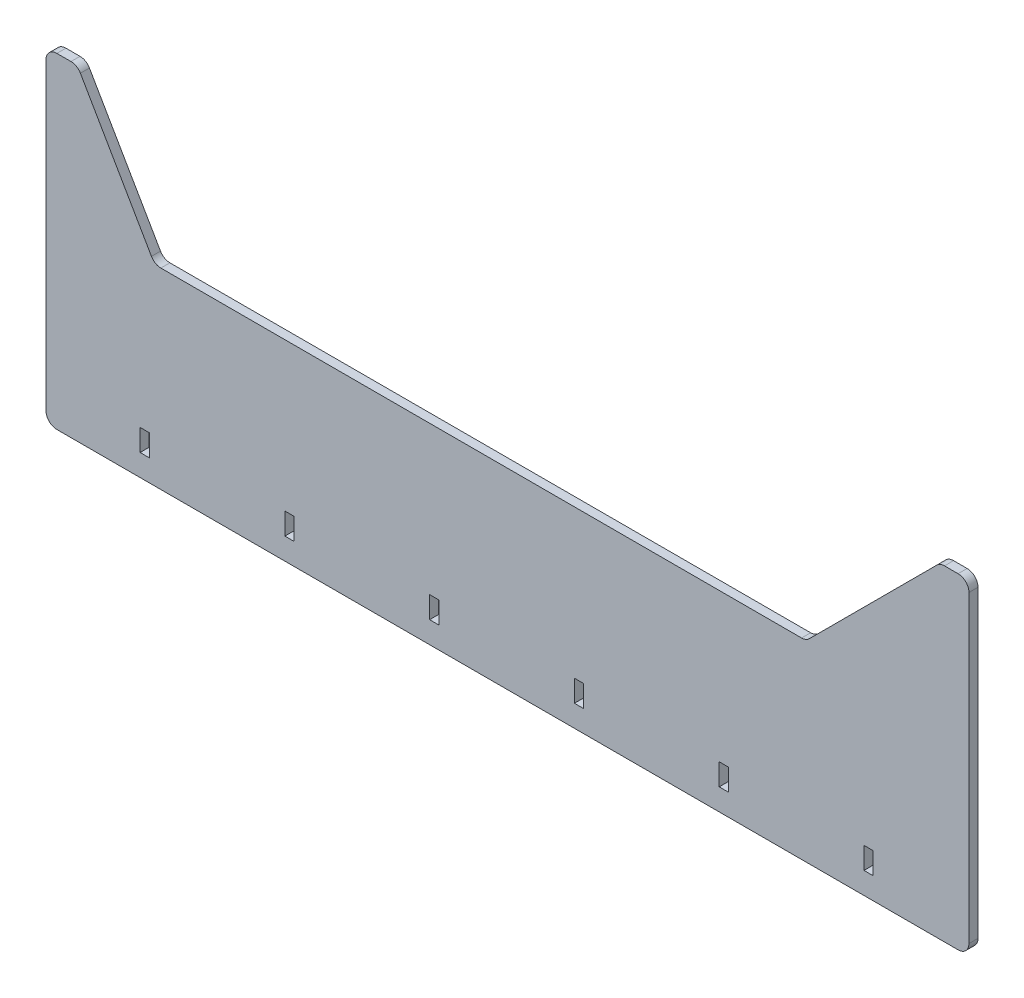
ISO-10303-21;
HEADER;
FILE_DESCRIPTION(('STEP AP214'),'2;1');
FILE_NAME('part.step','',(''),(''),'','','');
FILE_SCHEMA(('AUTOMOTIVE_DESIGN { 1 0 10303 214 1 1 1 1 }'));
ENDSEC;
DATA;
#1=APPLICATION_CONTEXT('core data for automotive mechanical design processes');
#2=APPLICATION_PROTOCOL_DEFINITION('international standard','automotive_design',2000,#1);
#3=PRODUCT_CONTEXT('',#1,'mechanical');
#4=PRODUCT('Part','Part','',(#3));
#5=PRODUCT_RELATED_PRODUCT_CATEGORY('part','',(#4));
#6=PRODUCT_DEFINITION_FORMATION('','',#4);
#7=PRODUCT_DEFINITION_CONTEXT('part definition',#1,'design');
#8=PRODUCT_DEFINITION('design','',#6,#7);
#9=PRODUCT_DEFINITION_SHAPE('','',#8);
#10=(LENGTH_UNIT() NAMED_UNIT(*) SI_UNIT(.MILLI.,.METRE.));
#11=(NAMED_UNIT(*) PLANE_ANGLE_UNIT() SI_UNIT($,.RADIAN.));
#12=(NAMED_UNIT(*) SI_UNIT($,.STERADIAN.) SOLID_ANGLE_UNIT());
#13=UNCERTAINTY_MEASURE_WITH_UNIT(LENGTH_MEASURE(1.E-05),#10,'distance_accuracy_value','');
#14=(GEOMETRIC_REPRESENTATION_CONTEXT(3) GLOBAL_UNCERTAINTY_ASSIGNED_CONTEXT((#13)) GLOBAL_UNIT_ASSIGNED_CONTEXT((#10,
#11,#12)) REPRESENTATION_CONTEXT('',''));
#15=CARTESIAN_POINT('',(0.,0.,0.));
#16=DIRECTION('',(0.,0.,1.));
#17=DIRECTION('',(1.,0.,0.));
#18=AXIS2_PLACEMENT_3D('',#15,#16,#17);
#19=CARTESIAN_POINT('',(0.,0.,2.5));
#20=DIRECTION('',(0.,0.,1.));
#21=DIRECTION('',(1.,0.,0.));
#22=AXIS2_PLACEMENT_3D('',#19,#20,#21);
#23=PLANE('',#22);
#24=DIRECTION('',(0.,-1.,0.));
#25=VECTOR('',#24,1.);
#26=CARTESIAN_POINT('',(-106.016483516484,44.8351648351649,2.5));
#27=LINE('',#26,#25);
#28=CARTESIAN_POINT('',(-106.016483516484,41.8351648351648,2.5));
#29=VERTEX_POINT('',#28);
#30=CARTESIAN_POINT('',(-106.016483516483,-42.1648351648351,2.5));
#31=VERTEX_POINT('',#30);
#32=EDGE_CURVE('E488',#29,#31,#27,.T.);
#33=ORIENTED_EDGE('',*,*,#32,.T.);
#34=CARTESIAN_POINT('',(-103.016483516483,-42.1648351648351,2.5));
#35=DIRECTION('',(0.,0.,1.));
#36=DIRECTION('',(1.,0.,0.));
#37=AXIS2_PLACEMENT_3D('',#34,#35,#36);
#38=CIRCLE('',#37,3.);
#39=CARTESIAN_POINT('',(-103.016483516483,-45.1648351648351,2.5));
#40=VERTEX_POINT('',#39);
#41=EDGE_CURVE('E563',#31,#40,#38,.T.);
#42=ORIENTED_EDGE('',*,*,#41,.T.);
#43=DIRECTION('',(1.,0.,0.));
#44=VECTOR('',#43,1.);
#45=CARTESIAN_POINT('',(-106.016483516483,-45.1648351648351,2.5));
#46=LINE('',#45,#44);
#47=CARTESIAN_POINT('',(145.983516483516,-45.1648351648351,2.5));
#48=VERTEX_POINT('',#47);
#49=EDGE_CURVE('E491',#40,#48,#46,.T.);
#50=ORIENTED_EDGE('',*,*,#49,.T.);
#51=CARTESIAN_POINT('',(145.983516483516,-42.1648351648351,2.5));
#52=DIRECTION('',(0.,0.,1.));
#53=DIRECTION('',(1.,0.,0.));
#54=AXIS2_PLACEMENT_3D('',#51,#52,#53);
#55=CIRCLE('',#54,3.);
#56=CARTESIAN_POINT('',(148.983516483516,-42.1648351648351,2.5));
#57=VERTEX_POINT('',#56);
#58=EDGE_CURVE('E561',#48,#57,#55,.T.);
#59=ORIENTED_EDGE('',*,*,#58,.T.);
#60=DIRECTION('',(0.,1.,0.));
#61=VECTOR('',#60,1.);
#62=CARTESIAN_POINT('',(148.983516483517,44.8351648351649,2.5));
#63=LINE('',#62,#61);
#64=CARTESIAN_POINT('',(148.983516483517,41.8351648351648,2.5));
#65=VERTEX_POINT('',#64);
#66=EDGE_CURVE('E495',#57,#65,#63,.T.);
#67=ORIENTED_EDGE('',*,*,#66,.T.);
#68=CARTESIAN_POINT('',(145.983516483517,41.8351648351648,2.5));
#69=DIRECTION('',(0.,0.,1.));
#70=DIRECTION('',(1.,0.,0.));
#71=AXIS2_PLACEMENT_3D('',#68,#69,#70);
#72=CIRCLE('',#71,3.);
#73=CARTESIAN_POINT('',(145.983516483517,44.8351648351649,2.5));
#74=VERTEX_POINT('',#73);
#75=EDGE_CURVE('E559',#65,#74,#72,.T.);
#76=ORIENTED_EDGE('',*,*,#75,.T.);
#77=DIRECTION('',(-1.,0.,0.));
#78=VECTOR('',#77,1.);
#79=CARTESIAN_POINT('',(140.983516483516,44.8351648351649,2.5));
#80=LINE('',#79,#78);
#81=CARTESIAN_POINT('',(142.226157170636,44.8351648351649,2.5));
#82=VERTEX_POINT('',#81);
#83=EDGE_CURVE('E498',#74,#82,#80,.T.);
#84=ORIENTED_EDGE('',*,*,#83,.T.);
#85=CARTESIAN_POINT('',(142.226157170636,41.8351648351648,2.5));
#86=DIRECTION('',(0.,0.,1.));
#87=DIRECTION('',(1.,0.,0.));
#88=AXIS2_PLACEMENT_3D('',#85,#86,#87);
#89=CIRCLE('',#88,3.);
#90=CARTESIAN_POINT('',(140.104836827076,43.9564851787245,2.5));
#91=VERTEX_POINT('',#90);
#92=EDGE_CURVE('E557',#82,#91,#89,.T.);
#93=ORIENTED_EDGE('',*,*,#92,.T.);
#94=DIRECTION('',(-0.707106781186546,-0.707106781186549,0.));
#95=VECTOR('',#94,1.);
#96=CARTESIAN_POINT('',(103.983516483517,7.83516483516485,2.5));
#97=LINE('',#96,#95);
#98=CARTESIAN_POINT('',(104.862196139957,8.71384449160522,2.5));
#99=VERTEX_POINT('',#98);
#100=EDGE_CURVE('E501',#91,#99,#97,.T.);
#101=ORIENTED_EDGE('',*,*,#100,.T.);
#102=CARTESIAN_POINT('',(102.740875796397,10.8351648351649,2.5));
#103=DIRECTION('',(0.,0.,1.));
#104=DIRECTION('',(1.,0.,0.));
#105=AXIS2_PLACEMENT_3D('',#102,#103,#104);
#106=CIRCLE('',#105,3.);
#107=CARTESIAN_POINT('',(102.740875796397,7.83516483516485,2.5));
#108=VERTEX_POINT('',#107);
#109=EDGE_CURVE('E596',#99,#108,#106,.F.);
#110=ORIENTED_EDGE('',*,*,#109,.T.);
#111=DIRECTION('',(-1.,0.,0.));
#112=VECTOR('',#111,1.);
#113=CARTESIAN_POINT('',(-76.0164835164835,7.83516483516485,2.5));
#114=LINE('',#113,#112);
#115=CARTESIAN_POINT('',(-74.2844327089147,7.83516483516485,2.5));
#116=VERTEX_POINT('',#115);
#117=EDGE_CURVE('E504',#108,#116,#114,.T.);
#118=ORIENTED_EDGE('',*,*,#117,.T.);
#119=CARTESIAN_POINT('',(-74.2844327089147,10.8351648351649,2.5));
#120=DIRECTION('',(0.,0.,1.));
#121=DIRECTION('',(1.,0.,0.));
#122=AXIS2_PLACEMENT_3D('',#119,#120,#121);
#123=CIRCLE('',#122,3.);
#124=CARTESIAN_POINT('',(-76.882508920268,9.33516483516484,2.5));
#125=VERTEX_POINT('',#124);
#126=EDGE_CURVE('E11',#116,#125,#123,.F.);
#127=ORIENTED_EDGE('',*,*,#126,.T.);
#128=DIRECTION('',(-0.500000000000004,0.866025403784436,0.));
#129=VECTOR('',#128,1.);
#130=CARTESIAN_POINT('',(-76.0164835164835,7.83516483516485,2.5));
#131=LINE('',#130,#129);
#132=CARTESIAN_POINT('',(-96.5124180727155,43.3351648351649,2.5));
#133=VERTEX_POINT('',#132);
#134=EDGE_CURVE('E507',#125,#133,#131,.T.);
#135=ORIENTED_EDGE('',*,*,#134,.T.);
#136=CARTESIAN_POINT('',(-99.1104942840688,41.8351648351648,2.5));
#137=DIRECTION('',(0.,0.,1.));
#138=DIRECTION('',(1.,0.,0.));
#139=AXIS2_PLACEMENT_3D('',#136,#137,#138);
#140=CIRCLE('',#139,3.);
#141=CARTESIAN_POINT('',(-99.1104942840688,44.8351648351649,2.5));
#142=VERTEX_POINT('',#141);
#143=EDGE_CURVE('E55',#133,#142,#140,.T.);
#144=ORIENTED_EDGE('',*,*,#143,.T.);
#145=DIRECTION('',(-1.,0.,0.));
#146=VECTOR('',#145,1.);
#147=CARTESIAN_POINT('',(-106.016483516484,44.8351648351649,2.5));
#148=LINE('',#147,#146);
#149=CARTESIAN_POINT('',(-103.016483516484,44.8351648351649,2.5));
#150=VERTEX_POINT('',#149);
#151=EDGE_CURVE('E509',#142,#150,#148,.T.);
#152=ORIENTED_EDGE('',*,*,#151,.T.);
#153=CARTESIAN_POINT('',(-103.016483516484,41.8351648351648,2.5));
#154=DIRECTION('',(0.,0.,1.));
#155=DIRECTION('',(1.,0.,0.));
#156=AXIS2_PLACEMENT_3D('',#153,#154,#155);
#157=CIRCLE('',#156,3.);
#158=EDGE_CURVE('E554',#150,#29,#157,.T.);
#159=ORIENTED_EDGE('',*,*,#158,.T.);
#160=EDGE_LOOP('',(#33,#42,#50,#59,#67,#76,#84,#93,#101,#110,#118,#127,#135,#144,#152,#159));
#161=FACE_BOUND('',#160,.T.);
#162=DIRECTION('',(1.,0.,0.));
#163=VECTOR('',#162,1.);
#164=CARTESIAN_POINT('',(-80.0164835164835,-39.1648351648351,2.5));
#165=LINE('',#164,#163);
#166=CARTESIAN_POINT('',(-80.0164835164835,-39.1648351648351,2.5));
#167=VERTEX_POINT('',#166);
#168=CARTESIAN_POINT('',(-77.4864835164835,-39.1648351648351,2.5));
#169=VERTEX_POINT('',#168);
#170=EDGE_CURVE('E459',#167,#169,#165,.T.);
#171=ORIENTED_EDGE('',*,*,#170,.F.);
#172=DIRECTION('',(0.,-1.,0.));
#173=VECTOR('',#172,1.);
#174=CARTESIAN_POINT('',(-80.0164835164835,-33.1648351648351,2.5));
#175=LINE('',#174,#173);
#176=CARTESIAN_POINT('',(-80.0164835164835,-33.1648351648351,2.5));
#177=VERTEX_POINT('',#176);
#178=EDGE_CURVE('E457',#177,#167,#175,.T.);
#179=ORIENTED_EDGE('',*,*,#178,.F.);
#180=DIRECTION('',(-1.,0.,0.));
#181=VECTOR('',#180,1.);
#182=CARTESIAN_POINT('',(-80.0164835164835,-33.1648351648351,2.5));
#183=LINE('',#182,#181);
#184=CARTESIAN_POINT('',(-77.4864835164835,-33.1648351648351,2.5));
#185=VERTEX_POINT('',#184);
#186=EDGE_CURVE('E465',#185,#177,#183,.T.);
#187=ORIENTED_EDGE('',*,*,#186,.F.);
#188=DIRECTION('',(0.,1.,0.));
#189=VECTOR('',#188,1.);
#190=CARTESIAN_POINT('',(-77.4864835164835,-33.1648351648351,2.5));
#191=LINE('',#190,#189);
#192=EDGE_CURVE('E462',#169,#185,#191,.T.);
#193=ORIENTED_EDGE('',*,*,#192,.F.);
#194=EDGE_LOOP('',(#171,#179,#187,#193));
#195=FACE_BOUND('',#194,.T.);
#196=DIRECTION('',(1.,0.,0.));
#197=VECTOR('',#196,1.);
#198=CARTESIAN_POINT('',(-40.0164835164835,-39.1648351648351,2.5));
#199=LINE('',#198,#197);
#200=CARTESIAN_POINT('',(-40.0164835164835,-39.1648351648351,2.5));
#201=VERTEX_POINT('',#200);
#202=CARTESIAN_POINT('',(-37.4864835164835,-39.1648351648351,2.5));
#203=VERTEX_POINT('',#202);
#204=EDGE_CURVE('E428',#201,#203,#199,.T.);
#205=ORIENTED_EDGE('',*,*,#204,.F.);
#206=DIRECTION('',(0.,-1.,0.));
#207=VECTOR('',#206,1.);
#208=CARTESIAN_POINT('',(-40.0164835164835,-33.1648351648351,2.5));
#209=LINE('',#208,#207);
#210=CARTESIAN_POINT('',(-40.0164835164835,-33.1648351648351,2.5));
#211=VERTEX_POINT('',#210);
#212=EDGE_CURVE('E426',#211,#201,#209,.T.);
#213=ORIENTED_EDGE('',*,*,#212,.F.);
#214=DIRECTION('',(-1.,0.,0.));
#215=VECTOR('',#214,1.);
#216=CARTESIAN_POINT('',(-40.0164835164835,-33.1648351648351,2.5));
#217=LINE('',#216,#215);
#218=CARTESIAN_POINT('',(-37.4864835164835,-33.1648351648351,2.5));
#219=VERTEX_POINT('',#218);
#220=EDGE_CURVE('E434',#219,#211,#217,.T.);
#221=ORIENTED_EDGE('',*,*,#220,.F.);
#222=DIRECTION('',(0.,1.,0.));
#223=VECTOR('',#222,1.);
#224=CARTESIAN_POINT('',(-37.4864835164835,-33.1648351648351,2.5));
#225=LINE('',#224,#223);
#226=EDGE_CURVE('E431',#203,#219,#225,.T.);
#227=ORIENTED_EDGE('',*,*,#226,.F.);
#228=EDGE_LOOP('',(#205,#213,#221,#227));
#229=FACE_BOUND('',#228,.T.);
#230=DIRECTION('',(1.,0.,0.));
#231=VECTOR('',#230,1.);
#232=CARTESIAN_POINT('',(-0.0164835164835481,-39.1648351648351,2.5));
#233=LINE('',#232,#231);
#234=CARTESIAN_POINT('',(-0.0164835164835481,-39.1648351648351,2.5));
#235=VERTEX_POINT('',#234);
#236=CARTESIAN_POINT('',(2.51351648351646,-39.1648351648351,2.5));
#237=VERTEX_POINT('',#236);
#238=EDGE_CURVE('E397',#235,#237,#233,.T.);
#239=ORIENTED_EDGE('',*,*,#238,.F.);
#240=DIRECTION('',(0.,-1.,0.));
#241=VECTOR('',#240,1.);
#242=CARTESIAN_POINT('',(-0.0164835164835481,-33.1648351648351,2.5));
#243=LINE('',#242,#241);
#244=CARTESIAN_POINT('',(-0.0164835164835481,-33.1648351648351,2.5));
#245=VERTEX_POINT('',#244);
#246=EDGE_CURVE('E395',#245,#235,#243,.T.);
#247=ORIENTED_EDGE('',*,*,#246,.F.);
#248=DIRECTION('',(-1.,0.,0.));
#249=VECTOR('',#248,1.);
#250=CARTESIAN_POINT('',(-0.0164835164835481,-33.1648351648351,2.5));
#251=LINE('',#250,#249);
#252=CARTESIAN_POINT('',(2.51351648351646,-33.1648351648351,2.5));
#253=VERTEX_POINT('',#252);
#254=EDGE_CURVE('E403',#253,#245,#251,.T.);
#255=ORIENTED_EDGE('',*,*,#254,.F.);
#256=DIRECTION('',(0.,1.,0.));
#257=VECTOR('',#256,1.);
#258=CARTESIAN_POINT('',(2.51351648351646,-33.1648351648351,2.5));
#259=LINE('',#258,#257);
#260=EDGE_CURVE('E400',#237,#253,#259,.T.);
#261=ORIENTED_EDGE('',*,*,#260,.F.);
#262=EDGE_LOOP('',(#239,#247,#255,#261));
#263=FACE_BOUND('',#262,.T.);
#264=DIRECTION('',(1.,0.,0.));
#265=VECTOR('',#264,1.);
#266=CARTESIAN_POINT('',(39.9835164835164,-39.1648351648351,2.5));
#267=LINE('',#266,#265);
#268=CARTESIAN_POINT('',(39.9835164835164,-39.1648351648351,2.5));
#269=VERTEX_POINT('',#268);
#270=CARTESIAN_POINT('',(42.5135164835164,-39.1648351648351,2.5));
#271=VERTEX_POINT('',#270);
#272=EDGE_CURVE('E366',#269,#271,#267,.T.);
#273=ORIENTED_EDGE('',*,*,#272,.F.);
#274=DIRECTION('',(0.,-1.,0.));
#275=VECTOR('',#274,1.);
#276=CARTESIAN_POINT('',(39.9835164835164,-33.1648351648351,2.5));
#277=LINE('',#276,#275);
#278=CARTESIAN_POINT('',(39.9835164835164,-33.1648351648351,2.5));
#279=VERTEX_POINT('',#278);
#280=EDGE_CURVE('E364',#279,#269,#277,.T.);
#281=ORIENTED_EDGE('',*,*,#280,.F.);
#282=DIRECTION('',(-1.,0.,0.));
#283=VECTOR('',#282,1.);
#284=CARTESIAN_POINT('',(39.9835164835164,-33.1648351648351,2.5));
#285=LINE('',#284,#283);
#286=CARTESIAN_POINT('',(42.5135164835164,-33.1648351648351,2.5));
#287=VERTEX_POINT('',#286);
#288=EDGE_CURVE('E372',#287,#279,#285,.T.);
#289=ORIENTED_EDGE('',*,*,#288,.F.);
#290=DIRECTION('',(0.,1.,0.));
#291=VECTOR('',#290,1.);
#292=CARTESIAN_POINT('',(42.5135164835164,-33.1648351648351,2.5));
#293=LINE('',#292,#291);
#294=EDGE_CURVE('E369',#271,#287,#293,.T.);
#295=ORIENTED_EDGE('',*,*,#294,.F.);
#296=EDGE_LOOP('',(#273,#281,#289,#295));
#297=FACE_BOUND('',#296,.T.);
#298=DIRECTION('',(1.,0.,0.));
#299=VECTOR('',#298,1.);
#300=CARTESIAN_POINT('',(79.9835164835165,-39.1648351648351,2.5));
#301=LINE('',#300,#299);
#302=CARTESIAN_POINT('',(79.9835164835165,-39.1648351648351,2.5));
#303=VERTEX_POINT('',#302);
#304=CARTESIAN_POINT('',(82.5135164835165,-39.1648351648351,2.5));
#305=VERTEX_POINT('',#304);
#306=EDGE_CURVE('E335',#303,#305,#301,.T.);
#307=ORIENTED_EDGE('',*,*,#306,.F.);
#308=DIRECTION('',(0.,-1.,0.));
#309=VECTOR('',#308,1.);
#310=CARTESIAN_POINT('',(79.9835164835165,-33.1648351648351,2.5));
#311=LINE('',#310,#309);
#312=CARTESIAN_POINT('',(79.9835164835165,-33.1648351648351,2.5));
#313=VERTEX_POINT('',#312);
#314=EDGE_CURVE('E333',#313,#303,#311,.T.);
#315=ORIENTED_EDGE('',*,*,#314,.F.);
#316=DIRECTION('',(-1.,0.,0.));
#317=VECTOR('',#316,1.);
#318=CARTESIAN_POINT('',(79.9835164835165,-33.1648351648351,2.5));
#319=LINE('',#318,#317);
#320=CARTESIAN_POINT('',(82.5135164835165,-33.1648351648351,2.5));
#321=VERTEX_POINT('',#320);
#322=EDGE_CURVE('E341',#321,#313,#319,.T.);
#323=ORIENTED_EDGE('',*,*,#322,.F.);
#324=DIRECTION('',(0.,1.,0.));
#325=VECTOR('',#324,1.);
#326=CARTESIAN_POINT('',(82.5135164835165,-33.1648351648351,2.5));
#327=LINE('',#326,#325);
#328=EDGE_CURVE('E338',#305,#321,#327,.T.);
#329=ORIENTED_EDGE('',*,*,#328,.F.);
#330=EDGE_LOOP('',(#307,#315,#323,#329));
#331=FACE_BOUND('',#330,.T.);
#332=DIRECTION('',(1.,0.,0.));
#333=VECTOR('',#332,1.);
#334=CARTESIAN_POINT('',(119.983516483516,-39.1648351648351,2.5));
#335=LINE('',#334,#333);
#336=CARTESIAN_POINT('',(119.983516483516,-39.1648351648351,2.5));
#337=VERTEX_POINT('',#336);
#338=CARTESIAN_POINT('',(122.513516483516,-39.1648351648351,2.5));
#339=VERTEX_POINT('',#338);
#340=EDGE_CURVE('E302',#337,#339,#335,.T.);
#341=ORIENTED_EDGE('',*,*,#340,.F.);
#342=DIRECTION('',(0.,-1.,0.));
#343=VECTOR('',#342,1.);
#344=CARTESIAN_POINT('',(119.983516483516,-33.1648351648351,2.5));
#345=LINE('',#344,#343);
#346=CARTESIAN_POINT('',(119.983516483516,-33.1648351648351,2.5));
#347=VERTEX_POINT('',#346);
#348=EDGE_CURVE('E292',#347,#337,#345,.T.);
#349=ORIENTED_EDGE('',*,*,#348,.F.);
#350=DIRECTION('',(-1.,0.,0.));
#351=VECTOR('',#350,1.);
#352=CARTESIAN_POINT('',(119.983516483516,-33.1648351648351,2.5));
#353=LINE('',#352,#351);
#354=CARTESIAN_POINT('',(122.513516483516,-33.1648351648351,2.5));
#355=VERTEX_POINT('',#354);
#356=EDGE_CURVE('E317',#355,#347,#353,.T.);
#357=ORIENTED_EDGE('',*,*,#356,.F.);
#358=DIRECTION('',(0.,1.,0.));
#359=VECTOR('',#358,1.);
#360=CARTESIAN_POINT('',(122.513516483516,-33.1648351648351,2.5));
#361=LINE('',#360,#359);
#362=EDGE_CURVE('E315',#339,#355,#361,.T.);
#363=ORIENTED_EDGE('',*,*,#362,.F.);
#364=EDGE_LOOP('',(#341,#349,#357,#363));
#365=FACE_BOUND('',#364,.T.);
#366=ADVANCED_FACE('F33',(#161,#195,#229,#263,#297,#331,#365),#23,.T.);
#367=CARTESIAN_POINT('',(0.,0.,0.));
#368=DIRECTION('',(0.,0.,1.));
#369=DIRECTION('',(1.,0.,0.));
#370=AXIS2_PLACEMENT_3D('',#367,#368,#369);
#371=PLANE('',#370);
#372=DIRECTION('',(0.,-1.,0.));
#373=VECTOR('',#372,1.);
#374=CARTESIAN_POINT('',(79.9835164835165,-33.1648351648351,0.));
#375=LINE('',#374,#373);
#376=CARTESIAN_POINT('',(79.9835164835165,-33.1648351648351,0.));
#377=VERTEX_POINT('',#376);
#378=CARTESIAN_POINT('',(79.9835164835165,-39.1648351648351,0.));
#379=VERTEX_POINT('',#378);
#380=EDGE_CURVE('E310',#377,#379,#375,.T.);
#381=ORIENTED_EDGE('',*,*,#380,.T.);
#382=DIRECTION('',(1.,0.,0.));
#383=VECTOR('',#382,1.);
#384=CARTESIAN_POINT('',(79.9835164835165,-39.1648351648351,0.));
#385=LINE('',#384,#383);
#386=CARTESIAN_POINT('',(82.5135164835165,-39.1648351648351,0.));
#387=VERTEX_POINT('',#386);
#388=EDGE_CURVE('E346',#379,#387,#385,.T.);
#389=ORIENTED_EDGE('',*,*,#388,.T.);
#390=DIRECTION('',(0.,1.,0.));
#391=VECTOR('',#390,1.);
#392=CARTESIAN_POINT('',(82.5135164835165,-33.1648351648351,0.));
#393=LINE('',#392,#391);
#394=CARTESIAN_POINT('',(82.5135164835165,-33.1648351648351,0.));
#395=VERTEX_POINT('',#394);
#396=EDGE_CURVE('E349',#387,#395,#393,.T.);
#397=ORIENTED_EDGE('',*,*,#396,.T.);
#398=DIRECTION('',(-1.,0.,0.));
#399=VECTOR('',#398,1.);
#400=CARTESIAN_POINT('',(79.9835164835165,-33.1648351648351,0.));
#401=LINE('',#400,#399);
#402=EDGE_CURVE('E336',#395,#377,#401,.T.);
#403=ORIENTED_EDGE('',*,*,#402,.T.);
#404=EDGE_LOOP('',(#381,#389,#397,#403));
#405=FACE_BOUND('',#404,.T.);
#406=DIRECTION('',(0.,-1.,0.));
#407=VECTOR('',#406,1.);
#408=CARTESIAN_POINT('',(-0.0164835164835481,-33.1648351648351,0.));
#409=LINE('',#408,#407);
#410=CARTESIAN_POINT('',(-0.0164835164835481,-33.1648351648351,0.));
#411=VERTEX_POINT('',#410);
#412=CARTESIAN_POINT('',(-0.0164835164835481,-39.1648351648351,0.));
#413=VERTEX_POINT('',#412);
#414=EDGE_CURVE('E394',#411,#413,#409,.T.);
#415=ORIENTED_EDGE('',*,*,#414,.T.);
#416=DIRECTION('',(1.,0.,0.));
#417=VECTOR('',#416,1.);
#418=CARTESIAN_POINT('',(-0.0164835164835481,-39.1648351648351,0.));
#419=LINE('',#418,#417);
#420=CARTESIAN_POINT('',(2.51351648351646,-39.1648351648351,0.));
#421=VERTEX_POINT('',#420);
#422=EDGE_CURVE('E408',#413,#421,#419,.T.);
#423=ORIENTED_EDGE('',*,*,#422,.T.);
#424=DIRECTION('',(0.,1.,0.));
#425=VECTOR('',#424,1.);
#426=CARTESIAN_POINT('',(2.51351648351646,-33.1648351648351,0.));
#427=LINE('',#426,#425);
#428=CARTESIAN_POINT('',(2.51351648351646,-33.1648351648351,0.));
#429=VERTEX_POINT('',#428);
#430=EDGE_CURVE('E411',#421,#429,#427,.T.);
#431=ORIENTED_EDGE('',*,*,#430,.T.);
#432=DIRECTION('',(-1.,0.,0.));
#433=VECTOR('',#432,1.);
#434=CARTESIAN_POINT('',(-0.0164835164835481,-33.1648351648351,0.));
#435=LINE('',#434,#433);
#436=EDGE_CURVE('E398',#429,#411,#435,.T.);
#437=ORIENTED_EDGE('',*,*,#436,.T.);
#438=EDGE_LOOP('',(#415,#423,#431,#437));
#439=FACE_BOUND('',#438,.T.);
#440=DIRECTION('',(0.,-1.,0.));
#441=VECTOR('',#440,1.);
#442=CARTESIAN_POINT('',(-80.0164835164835,-33.1648351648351,0.));
#443=LINE('',#442,#441);
#444=CARTESIAN_POINT('',(-80.0164835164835,-33.1648351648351,0.));
#445=VERTEX_POINT('',#444);
#446=CARTESIAN_POINT('',(-80.0164835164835,-39.1648351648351,0.));
#447=VERTEX_POINT('',#446);
#448=EDGE_CURVE('E456',#445,#447,#443,.T.);
#449=ORIENTED_EDGE('',*,*,#448,.T.);
#450=DIRECTION('',(1.,0.,0.));
#451=VECTOR('',#450,1.);
#452=CARTESIAN_POINT('',(-80.0164835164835,-39.1648351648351,0.));
#453=LINE('',#452,#451);
#454=CARTESIAN_POINT('',(-77.4864835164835,-39.1648351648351,0.));
#455=VERTEX_POINT('',#454);
#456=EDGE_CURVE('E470',#447,#455,#453,.T.);
#457=ORIENTED_EDGE('',*,*,#456,.T.);
#458=DIRECTION('',(0.,1.,0.));
#459=VECTOR('',#458,1.);
#460=CARTESIAN_POINT('',(-77.4864835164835,-33.1648351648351,0.));
#461=LINE('',#460,#459);
#462=CARTESIAN_POINT('',(-77.4864835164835,-33.1648351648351,0.));
#463=VERTEX_POINT('',#462);
#464=EDGE_CURVE('E473',#455,#463,#461,.T.);
#465=ORIENTED_EDGE('',*,*,#464,.T.);
#466=DIRECTION('',(-1.,0.,0.));
#467=VECTOR('',#466,1.);
#468=CARTESIAN_POINT('',(-80.0164835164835,-33.1648351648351,0.));
#469=LINE('',#468,#467);
#470=EDGE_CURVE('E460',#463,#445,#469,.T.);
#471=ORIENTED_EDGE('',*,*,#470,.T.);
#472=EDGE_LOOP('',(#449,#457,#465,#471));
#473=FACE_BOUND('',#472,.T.);
#474=DIRECTION('',(1.,0.,0.));
#475=VECTOR('',#474,1.);
#476=CARTESIAN_POINT('',(-106.016483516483,-45.1648351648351,0.));
#477=LINE('',#476,#475);
#478=CARTESIAN_POINT('',(-103.016483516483,-45.1648351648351,0.));
#479=VERTEX_POINT('',#478);
#480=CARTESIAN_POINT('',(145.983516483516,-45.1648351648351,0.));
#481=VERTEX_POINT('',#480);
#482=EDGE_CURVE('E514',#479,#481,#477,.T.);
#483=ORIENTED_EDGE('',*,*,#482,.F.);
#484=CARTESIAN_POINT('',(-103.016483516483,-42.1648351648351,0.));
#485=DIRECTION('',(0.,0.,1.));
#486=DIRECTION('',(1.,0.,0.));
#487=AXIS2_PLACEMENT_3D('',#484,#485,#486);
#488=CIRCLE('',#487,3.);
#489=CARTESIAN_POINT('',(-106.016483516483,-42.1648351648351,0.));
#490=VERTEX_POINT('',#489);
#491=EDGE_CURVE('E547',#479,#490,#488,.F.);
#492=ORIENTED_EDGE('',*,*,#491,.T.);
#493=DIRECTION('',(0.,-1.,0.));
#494=VECTOR('',#493,1.);
#495=CARTESIAN_POINT('',(-106.016483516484,44.8351648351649,0.));
#496=LINE('',#495,#494);
#497=CARTESIAN_POINT('',(-106.016483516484,41.8351648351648,0.));
#498=VERTEX_POINT('',#497);
#499=EDGE_CURVE('E487',#498,#490,#496,.T.);
#500=ORIENTED_EDGE('',*,*,#499,.F.);
#501=CARTESIAN_POINT('',(-103.016483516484,41.8351648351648,0.));
#502=DIRECTION('',(0.,0.,1.));
#503=DIRECTION('',(1.,0.,0.));
#504=AXIS2_PLACEMENT_3D('',#501,#502,#503);
#505=CIRCLE('',#504,3.);
#506=CARTESIAN_POINT('',(-103.016483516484,44.8351648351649,0.));
#507=VERTEX_POINT('',#506);
#508=EDGE_CURVE('E537',#498,#507,#505,.F.);
#509=ORIENTED_EDGE('',*,*,#508,.T.);
#510=DIRECTION('',(-1.,0.,0.));
#511=VECTOR('',#510,1.);
#512=CARTESIAN_POINT('',(-106.016483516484,44.8351648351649,0.));
#513=LINE('',#512,#511);
#514=CARTESIAN_POINT('',(-99.1104942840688,44.8351648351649,0.));
#515=VERTEX_POINT('',#514);
#516=EDGE_CURVE('E492',#515,#507,#513,.T.);
#517=ORIENTED_EDGE('',*,*,#516,.F.);
#518=CARTESIAN_POINT('',(-99.1104942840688,41.8351648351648,0.));
#519=DIRECTION('',(0.,0.,1.));
#520=DIRECTION('',(1.,0.,0.));
#521=AXIS2_PLACEMENT_3D('',#518,#519,#520);
#522=CIRCLE('',#521,3.);
#523=CARTESIAN_POINT('',(-96.5124180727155,43.3351648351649,0.));
#524=VERTEX_POINT('',#523);
#525=EDGE_CURVE('E539',#515,#524,#522,.F.);
#526=ORIENTED_EDGE('',*,*,#525,.T.);
#527=DIRECTION('',(-0.500000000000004,0.866025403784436,0.));
#528=VECTOR('',#527,1.);
#529=CARTESIAN_POINT('',(-76.0164835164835,7.83516483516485,0.));
#530=LINE('',#529,#528);
#531=CARTESIAN_POINT('',(-76.882508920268,9.33516483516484,0.));
#532=VERTEX_POINT('',#531);
#533=EDGE_CURVE('E529',#532,#524,#530,.T.);
#534=ORIENTED_EDGE('',*,*,#533,.F.);
#535=CARTESIAN_POINT('',(-74.2844327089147,10.8351648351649,0.));
#536=DIRECTION('',(0.,0.,1.));
#537=DIRECTION('',(1.,0.,0.));
#538=AXIS2_PLACEMENT_3D('',#535,#536,#537);
#539=CIRCLE('',#538,3.);
#540=CARTESIAN_POINT('',(-74.2844327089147,7.83516483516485,0.));
#541=VERTEX_POINT('',#540);
#542=EDGE_CURVE('E41',#532,#541,#539,.T.);
#543=ORIENTED_EDGE('',*,*,#542,.T.);
#544=DIRECTION('',(-1.,0.,0.));
#545=VECTOR('',#544,1.);
#546=CARTESIAN_POINT('',(-76.0164835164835,7.83516483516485,0.));
#547=LINE('',#546,#545);
#548=CARTESIAN_POINT('',(102.740875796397,7.83516483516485,0.));
#549=VERTEX_POINT('',#548);
#550=EDGE_CURVE('E526',#549,#541,#547,.T.);
#551=ORIENTED_EDGE('',*,*,#550,.F.);
#552=CARTESIAN_POINT('',(102.740875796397,10.8351648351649,0.));
#553=DIRECTION('',(0.,0.,1.));
#554=DIRECTION('',(1.,0.,0.));
#555=AXIS2_PLACEMENT_3D('',#552,#553,#554);
#556=CIRCLE('',#555,3.);
#557=CARTESIAN_POINT('',(104.862196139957,8.71384449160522,0.));
#558=VERTEX_POINT('',#557);
#559=EDGE_CURVE('E594',#549,#558,#556,.T.);
#560=ORIENTED_EDGE('',*,*,#559,.T.);
#561=DIRECTION('',(-0.707106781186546,-0.707106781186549,0.));
#562=VECTOR('',#561,1.);
#563=CARTESIAN_POINT('',(103.983516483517,7.83516483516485,0.));
#564=LINE('',#563,#562);
#565=CARTESIAN_POINT('',(140.104836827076,43.9564851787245,0.));
#566=VERTEX_POINT('',#565);
#567=EDGE_CURVE('E523',#566,#558,#564,.T.);
#568=ORIENTED_EDGE('',*,*,#567,.F.);
#569=CARTESIAN_POINT('',(142.226157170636,41.8351648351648,0.));
#570=DIRECTION('',(0.,0.,1.));
#571=DIRECTION('',(1.,0.,0.));
#572=AXIS2_PLACEMENT_3D('',#569,#570,#571);
#573=CIRCLE('',#572,3.);
#574=CARTESIAN_POINT('',(142.226157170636,44.8351648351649,0.));
#575=VERTEX_POINT('',#574);
#576=EDGE_CURVE('E541',#566,#575,#573,.F.);
#577=ORIENTED_EDGE('',*,*,#576,.T.);
#578=DIRECTION('',(-1.,0.,0.));
#579=VECTOR('',#578,1.);
#580=CARTESIAN_POINT('',(140.983516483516,44.8351648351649,0.));
#581=LINE('',#580,#579);
#582=CARTESIAN_POINT('',(145.983516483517,44.8351648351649,0.));
#583=VERTEX_POINT('',#582);
#584=EDGE_CURVE('E520',#583,#575,#581,.T.);
#585=ORIENTED_EDGE('',*,*,#584,.F.);
#586=CARTESIAN_POINT('',(145.983516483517,41.8351648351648,0.));
#587=DIRECTION('',(0.,0.,1.));
#588=DIRECTION('',(1.,0.,0.));
#589=AXIS2_PLACEMENT_3D('',#586,#587,#588);
#590=CIRCLE('',#589,3.);
#591=CARTESIAN_POINT('',(148.983516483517,41.8351648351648,0.));
#592=VERTEX_POINT('',#591);
#593=EDGE_CURVE('E543',#583,#592,#590,.F.);
#594=ORIENTED_EDGE('',*,*,#593,.T.);
#595=DIRECTION('',(0.,1.,0.));
#596=VECTOR('',#595,1.);
#597=CARTESIAN_POINT('',(148.983516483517,44.8351648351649,0.));
#598=LINE('',#597,#596);
#599=CARTESIAN_POINT('',(148.983516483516,-42.1648351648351,0.));
#600=VERTEX_POINT('',#599);
#601=EDGE_CURVE('E517',#600,#592,#598,.T.);
#602=ORIENTED_EDGE('',*,*,#601,.F.);
#603=CARTESIAN_POINT('',(145.983516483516,-42.1648351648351,0.));
#604=DIRECTION('',(0.,0.,1.));
#605=DIRECTION('',(1.,0.,0.));
#606=AXIS2_PLACEMENT_3D('',#603,#604,#605);
#607=CIRCLE('',#606,3.);
#608=EDGE_CURVE('E545',#600,#481,#607,.F.);
#609=ORIENTED_EDGE('',*,*,#608,.T.);
#610=EDGE_LOOP('',(#483,#492,#500,#509,#517,#526,#534,#543,#551,#560,#568,#577,#585,#594,#602,#609));
#611=FACE_BOUND('',#610,.T.);
#612=DIRECTION('',(0.,-1.,0.));
#613=VECTOR('',#612,1.);
#614=CARTESIAN_POINT('',(-40.0164835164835,-33.1648351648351,0.));
#615=LINE('',#614,#613);
#616=CARTESIAN_POINT('',(-40.0164835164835,-33.1648351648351,0.));
#617=VERTEX_POINT('',#616);
#618=CARTESIAN_POINT('',(-40.0164835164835,-39.1648351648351,0.));
#619=VERTEX_POINT('',#618);
#620=EDGE_CURVE('E425',#617,#619,#615,.T.);
#621=ORIENTED_EDGE('',*,*,#620,.T.);
#622=DIRECTION('',(1.,0.,0.));
#623=VECTOR('',#622,1.);
#624=CARTESIAN_POINT('',(-40.0164835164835,-39.1648351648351,0.));
#625=LINE('',#624,#623);
#626=CARTESIAN_POINT('',(-37.4864835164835,-39.1648351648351,0.));
#627=VERTEX_POINT('',#626);
#628=EDGE_CURVE('E439',#619,#627,#625,.T.);
#629=ORIENTED_EDGE('',*,*,#628,.T.);
#630=DIRECTION('',(0.,1.,0.));
#631=VECTOR('',#630,1.);
#632=CARTESIAN_POINT('',(-37.4864835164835,-33.1648351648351,0.));
#633=LINE('',#632,#631);
#634=CARTESIAN_POINT('',(-37.4864835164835,-33.1648351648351,0.));
#635=VERTEX_POINT('',#634);
#636=EDGE_CURVE('E442',#627,#635,#633,.T.);
#637=ORIENTED_EDGE('',*,*,#636,.T.);
#638=DIRECTION('',(-1.,0.,0.));
#639=VECTOR('',#638,1.);
#640=CARTESIAN_POINT('',(-40.0164835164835,-33.1648351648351,0.));
#641=LINE('',#640,#639);
#642=EDGE_CURVE('E429',#635,#617,#641,.T.);
#643=ORIENTED_EDGE('',*,*,#642,.T.);
#644=EDGE_LOOP('',(#621,#629,#637,#643));
#645=FACE_BOUND('',#644,.T.);
#646=DIRECTION('',(0.,-1.,0.));
#647=VECTOR('',#646,1.);
#648=CARTESIAN_POINT('',(39.9835164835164,-33.1648351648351,0.));
#649=LINE('',#648,#647);
#650=CARTESIAN_POINT('',(39.9835164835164,-33.1648351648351,0.));
#651=VERTEX_POINT('',#650);
#652=CARTESIAN_POINT('',(39.9835164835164,-39.1648351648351,0.));
#653=VERTEX_POINT('',#652);
#654=EDGE_CURVE('E363',#651,#653,#649,.T.);
#655=ORIENTED_EDGE('',*,*,#654,.T.);
#656=DIRECTION('',(1.,0.,0.));
#657=VECTOR('',#656,1.);
#658=CARTESIAN_POINT('',(39.9835164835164,-39.1648351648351,0.));
#659=LINE('',#658,#657);
#660=CARTESIAN_POINT('',(42.5135164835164,-39.1648351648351,0.));
#661=VERTEX_POINT('',#660);
#662=EDGE_CURVE('E377',#653,#661,#659,.T.);
#663=ORIENTED_EDGE('',*,*,#662,.T.);
#664=DIRECTION('',(0.,1.,0.));
#665=VECTOR('',#664,1.);
#666=CARTESIAN_POINT('',(42.5135164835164,-33.1648351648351,0.));
#667=LINE('',#666,#665);
#668=CARTESIAN_POINT('',(42.5135164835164,-33.1648351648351,0.));
#669=VERTEX_POINT('',#668);
#670=EDGE_CURVE('E380',#661,#669,#667,.T.);
#671=ORIENTED_EDGE('',*,*,#670,.T.);
#672=DIRECTION('',(-1.,0.,0.));
#673=VECTOR('',#672,1.);
#674=CARTESIAN_POINT('',(39.9835164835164,-33.1648351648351,0.));
#675=LINE('',#674,#673);
#676=EDGE_CURVE('E367',#669,#651,#675,.T.);
#677=ORIENTED_EDGE('',*,*,#676,.T.);
#678=EDGE_LOOP('',(#655,#663,#671,#677));
#679=FACE_BOUND('',#678,.T.);
#680=DIRECTION('',(0.,-1.,0.));
#681=VECTOR('',#680,1.);
#682=CARTESIAN_POINT('',(119.983516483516,-33.1648351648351,0.));
#683=LINE('',#682,#681);
#684=CARTESIAN_POINT('',(119.983516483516,-33.1648351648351,0.));
#685=VERTEX_POINT('',#684);
#686=CARTESIAN_POINT('',(119.983516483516,-39.1648351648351,0.));
#687=VERTEX_POINT('',#686);
#688=EDGE_CURVE('E321',#685,#687,#683,.T.);
#689=ORIENTED_EDGE('',*,*,#688,.T.);
#690=DIRECTION('',(1.,0.,0.));
#691=VECTOR('',#690,1.);
#692=CARTESIAN_POINT('',(119.983516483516,-39.1648351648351,0.));
#693=LINE('',#692,#691);
#694=CARTESIAN_POINT('',(122.513516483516,-39.1648351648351,0.));
#695=VERTEX_POINT('',#694);
#696=EDGE_CURVE('E309',#687,#695,#693,.T.);
#697=ORIENTED_EDGE('',*,*,#696,.T.);
#698=DIRECTION('',(0.,1.,0.));
#699=VECTOR('',#698,1.);
#700=CARTESIAN_POINT('',(122.513516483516,-33.1648351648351,0.));
#701=LINE('',#700,#699);
#702=CARTESIAN_POINT('',(122.513516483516,-33.1648351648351,0.));
#703=VERTEX_POINT('',#702);
#704=EDGE_CURVE('E324',#695,#703,#701,.T.);
#705=ORIENTED_EDGE('',*,*,#704,.T.);
#706=DIRECTION('',(-1.,0.,0.));
#707=VECTOR('',#706,1.);
#708=CARTESIAN_POINT('',(119.983516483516,-33.1648351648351,0.));
#709=LINE('',#708,#707);
#710=EDGE_CURVE('E303',#703,#685,#709,.T.);
#711=ORIENTED_EDGE('',*,*,#710,.T.);
#712=EDGE_LOOP('',(#689,#697,#705,#711));
#713=FACE_BOUND('',#712,.T.);
#714=ADVANCED_FACE('F601',(#405,#439,#473,#611,#645,#679,#713),#371,.F.);
#715=CARTESIAN_POINT('',(-106.016483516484,44.8351648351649,2.5));
#716=DIRECTION('',(1.,0.,0.));
#717=DIRECTION('',(0.,1.,0.));
#718=AXIS2_PLACEMENT_3D('',#715,#716,#717);
#719=PLANE('',#718);
#720=ORIENTED_EDGE('',*,*,#499,.T.);
#721=DIRECTION('',(0.,0.,-1.));
#722=VECTOR('',#721,1.);
#723=CARTESIAN_POINT('',(-106.016483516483,-42.1648351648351,2.5));
#724=LINE('',#723,#722);
#725=EDGE_CURVE('E552',#490,#31,#724,.F.);
#726=ORIENTED_EDGE('',*,*,#725,.T.);
#727=ORIENTED_EDGE('',*,*,#32,.F.);
#728=DIRECTION('',(0.,0.,-1.));
#729=VECTOR('',#728,1.);
#730=CARTESIAN_POINT('',(-106.016483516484,41.8351648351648,2.5));
#731=LINE('',#730,#729);
#732=EDGE_CURVE('E549',#29,#498,#731,.T.);
#733=ORIENTED_EDGE('',*,*,#732,.T.);
#734=EDGE_LOOP('',(#720,#726,#727,#733));
#735=FACE_BOUND('',#734,.T.);
#736=ADVANCED_FACE('F628',(#735),#719,.F.);
#737=CARTESIAN_POINT('',(-106.016483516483,-45.1648351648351,2.5));
#738=DIRECTION('',(0.,1.,0.));
#739=DIRECTION('',(0.,0.,1.));
#740=AXIS2_PLACEMENT_3D('',#737,#738,#739);
#741=PLANE('',#740);
#742=ORIENTED_EDGE('',*,*,#49,.F.);
#743=DIRECTION('',(0.,0.,-1.));
#744=VECTOR('',#743,1.);
#745=CARTESIAN_POINT('',(-103.016483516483,-45.1648351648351,2.5));
#746=LINE('',#745,#744);
#747=EDGE_CURVE('E534',#40,#479,#746,.T.);
#748=ORIENTED_EDGE('',*,*,#747,.T.);
#749=ORIENTED_EDGE('',*,*,#482,.T.);
#750=DIRECTION('',(0.,0.,-1.));
#751=VECTOR('',#750,1.);
#752=CARTESIAN_POINT('',(145.983516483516,-45.1648351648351,2.5));
#753=LINE('',#752,#751);
#754=EDGE_CURVE('E511',#481,#48,#753,.F.);
#755=ORIENTED_EDGE('',*,*,#754,.T.);
#756=EDGE_LOOP('',(#742,#748,#749,#755));
#757=FACE_BOUND('',#756,.T.);
#758=ADVANCED_FACE('F636',(#757),#741,.F.);
#759=CARTESIAN_POINT('',(148.983516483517,44.8351648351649,2.5));
#760=DIRECTION('',(-1.,0.,0.));
#761=DIRECTION('',(0.,-1.,0.));
#762=AXIS2_PLACEMENT_3D('',#759,#760,#761);
#763=PLANE('',#762);
#764=ORIENTED_EDGE('',*,*,#66,.F.);
#765=DIRECTION('',(0.,0.,-1.));
#766=VECTOR('',#765,1.);
#767=CARTESIAN_POINT('',(148.983516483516,-42.1648351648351,2.5));
#768=LINE('',#767,#766);
#769=EDGE_CURVE('E567',#57,#600,#768,.T.);
#770=ORIENTED_EDGE('',*,*,#769,.T.);
#771=ORIENTED_EDGE('',*,*,#601,.T.);
#772=DIRECTION('',(0.,0.,-1.));
#773=VECTOR('',#772,1.);
#774=CARTESIAN_POINT('',(148.983516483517,41.8351648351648,2.5));
#775=LINE('',#774,#773);
#776=EDGE_CURVE('E565',#592,#65,#775,.F.);
#777=ORIENTED_EDGE('',*,*,#776,.T.);
#778=EDGE_LOOP('',(#764,#770,#771,#777));
#779=FACE_BOUND('',#778,.T.);
#780=ADVANCED_FACE('F645',(#779),#763,.F.);
#781=CARTESIAN_POINT('',(140.983516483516,44.8351648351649,2.5));
#782=DIRECTION('',(0.,-1.,0.));
#783=DIRECTION('',(0.,0.,-1.));
#784=AXIS2_PLACEMENT_3D('',#781,#782,#783);
#785=PLANE('',#784);
#786=ORIENTED_EDGE('',*,*,#83,.F.);
#787=DIRECTION('',(0.,0.,-1.));
#788=VECTOR('',#787,1.);
#789=CARTESIAN_POINT('',(145.983516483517,44.8351648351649,2.5));
#790=LINE('',#789,#788);
#791=EDGE_CURVE('E572',#74,#583,#790,.T.);
#792=ORIENTED_EDGE('',*,*,#791,.T.);
#793=ORIENTED_EDGE('',*,*,#584,.T.);
#794=DIRECTION('',(0.,0.,-1.));
#795=VECTOR('',#794,1.);
#796=CARTESIAN_POINT('',(142.226157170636,44.8351648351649,2.5));
#797=LINE('',#796,#795);
#798=EDGE_CURVE('E570',#575,#82,#797,.F.);
#799=ORIENTED_EDGE('',*,*,#798,.T.);
#800=EDGE_LOOP('',(#786,#792,#793,#799));
#801=FACE_BOUND('',#800,.T.);
#802=ADVANCED_FACE('F654',(#801),#785,.F.);
#803=CARTESIAN_POINT('',(103.983516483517,7.83516483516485,2.5));
#804=DIRECTION('',(0.707106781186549,-0.707106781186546,0.));
#805=DIRECTION('',(0.707106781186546,0.707106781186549,0.));
#806=AXIS2_PLACEMENT_3D('',#803,#804,#805);
#807=PLANE('',#806);
#808=ORIENTED_EDGE('',*,*,#100,.F.);
#809=DIRECTION('',(0.,0.,-1.));
#810=VECTOR('',#809,1.);
#811=CARTESIAN_POINT('',(140.104836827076,43.9564851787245,2.5));
#812=LINE('',#811,#810);
#813=EDGE_CURVE('E577',#91,#566,#812,.T.);
#814=ORIENTED_EDGE('',*,*,#813,.T.);
#815=ORIENTED_EDGE('',*,*,#567,.T.);
#816=DIRECTION('',(0.,0.,-1.));
#817=VECTOR('',#816,1.);
#818=CARTESIAN_POINT('',(104.862196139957,8.71384449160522,2.5));
#819=LINE('',#818,#817);
#820=EDGE_CURVE('E575',#558,#99,#819,.F.);
#821=ORIENTED_EDGE('',*,*,#820,.T.);
#822=EDGE_LOOP('',(#808,#814,#815,#821));
#823=FACE_BOUND('',#822,.T.);
#824=ADVANCED_FACE('F663',(#823),#807,.F.);
#825=CARTESIAN_POINT('',(-76.0164835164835,7.83516483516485,2.5));
#826=DIRECTION('',(0.,-1.,0.));
#827=DIRECTION('',(0.,0.,-1.));
#828=AXIS2_PLACEMENT_3D('',#825,#826,#827);
#829=PLANE('',#828);
#830=ORIENTED_EDGE('',*,*,#117,.F.);
#831=DIRECTION('',(0.,0.,-1.));
#832=VECTOR('',#831,1.);
#833=CARTESIAN_POINT('',(102.740875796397,7.83516483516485,0.));
#834=LINE('',#833,#832);
#835=EDGE_CURVE('E582',#108,#549,#834,.T.);
#836=ORIENTED_EDGE('',*,*,#835,.T.);
#837=ORIENTED_EDGE('',*,*,#550,.T.);
#838=DIRECTION('',(0.,0.,-1.));
#839=VECTOR('',#838,1.);
#840=CARTESIAN_POINT('',(-74.2844327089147,7.83516483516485,2.5));
#841=LINE('',#840,#839);
#842=EDGE_CURVE('E580',#541,#116,#841,.F.);
#843=ORIENTED_EDGE('',*,*,#842,.T.);
#844=EDGE_LOOP('',(#830,#836,#837,#843));
#845=FACE_BOUND('',#844,.T.);
#846=ADVANCED_FACE('F608',(#845),#829,.F.);
#847=CARTESIAN_POINT('',(-76.0164835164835,7.83516483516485,2.5));
#848=DIRECTION('',(-0.866025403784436,-0.500000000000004,0.));
#849=DIRECTION('',(0.500000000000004,-0.866025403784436,0.));
#850=AXIS2_PLACEMENT_3D('',#847,#848,#849);
#851=PLANE('',#850);
#852=ORIENTED_EDGE('',*,*,#134,.F.);
#853=DIRECTION('',(0.,0.,-1.));
#854=VECTOR('',#853,1.);
#855=CARTESIAN_POINT('',(-76.882508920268,9.33516483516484,0.));
#856=LINE('',#855,#854);
#857=EDGE_CURVE('E587',#125,#532,#856,.T.);
#858=ORIENTED_EDGE('',*,*,#857,.T.);
#859=ORIENTED_EDGE('',*,*,#533,.T.);
#860=DIRECTION('',(0.,0.,-1.));
#861=VECTOR('',#860,1.);
#862=CARTESIAN_POINT('',(-96.5124180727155,43.3351648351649,2.5));
#863=LINE('',#862,#861);
#864=EDGE_CURVE('E585',#524,#133,#863,.F.);
#865=ORIENTED_EDGE('',*,*,#864,.T.);
#866=EDGE_LOOP('',(#852,#858,#859,#865));
#867=FACE_BOUND('',#866,.T.);
#868=ADVANCED_FACE('F615',(#867),#851,.F.);
#869=CARTESIAN_POINT('',(-106.016483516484,44.8351648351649,2.5));
#870=DIRECTION('',(0.,-1.,0.));
#871=DIRECTION('',(0.,0.,-1.));
#872=AXIS2_PLACEMENT_3D('',#869,#870,#871);
#873=PLANE('',#872);
#874=ORIENTED_EDGE('',*,*,#151,.F.);
#875=DIRECTION('',(0.,0.,-1.));
#876=VECTOR('',#875,1.);
#877=CARTESIAN_POINT('',(-99.1104942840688,44.8351648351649,2.5));
#878=LINE('',#877,#876);
#879=EDGE_CURVE('E591',#142,#515,#878,.T.);
#880=ORIENTED_EDGE('',*,*,#879,.T.);
#881=ORIENTED_EDGE('',*,*,#516,.T.);
#882=DIRECTION('',(0.,0.,-1.));
#883=VECTOR('',#882,1.);
#884=CARTESIAN_POINT('',(-103.016483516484,44.8351648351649,2.5));
#885=LINE('',#884,#883);
#886=EDGE_CURVE('E48',#507,#150,#885,.F.);
#887=ORIENTED_EDGE('',*,*,#886,.T.);
#888=EDGE_LOOP('',(#874,#880,#881,#887));
#889=FACE_BOUND('',#888,.T.);
#890=ADVANCED_FACE('F621',(#889),#873,.F.);
#891=CARTESIAN_POINT('',(-80.0164835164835,-33.1648351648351,2.5));
#892=DIRECTION('',(1.,0.,0.));
#893=DIRECTION('',(0.,0.,-1.));
#894=AXIS2_PLACEMENT_3D('',#891,#892,#893);
#895=PLANE('',#894);
#896=ORIENTED_EDGE('',*,*,#448,.F.);
#897=DIRECTION('',(0.,0.,-1.));
#898=VECTOR('',#897,1.);
#899=CARTESIAN_POINT('',(-80.0164835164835,-33.1648351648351,2.5));
#900=LINE('',#899,#898);
#901=EDGE_CURVE('E467',#177,#445,#900,.T.);
#902=ORIENTED_EDGE('',*,*,#901,.F.);
#903=ORIENTED_EDGE('',*,*,#178,.T.);
#904=DIRECTION('',(0.,0.,-1.));
#905=VECTOR('',#904,1.);
#906=CARTESIAN_POINT('',(-80.0164835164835,-39.1648351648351,2.5));
#907=LINE('',#906,#905);
#908=EDGE_CURVE('E484',#167,#447,#907,.T.);
#909=ORIENTED_EDGE('',*,*,#908,.T.);
#910=EDGE_LOOP('',(#896,#902,#903,#909));
#911=FACE_BOUND('',#910,.T.);
#912=ADVANCED_FACE('F684',(#911),#895,.T.);
#913=CARTESIAN_POINT('',(-80.0164835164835,-39.1648351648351,2.5));
#914=DIRECTION('',(0.,1.,0.));
#915=DIRECTION('',(0.,0.,1.));
#916=AXIS2_PLACEMENT_3D('',#913,#914,#915);
#917=PLANE('',#916);
#918=ORIENTED_EDGE('',*,*,#456,.F.);
#919=ORIENTED_EDGE('',*,*,#908,.F.);
#920=ORIENTED_EDGE('',*,*,#170,.T.);
#921=DIRECTION('',(0.,0.,-1.));
#922=VECTOR('',#921,1.);
#923=CARTESIAN_POINT('',(-77.4864835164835,-39.1648351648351,2.5));
#924=LINE('',#923,#922);
#925=EDGE_CURVE('E482',#169,#455,#924,.T.);
#926=ORIENTED_EDGE('',*,*,#925,.T.);
#927=EDGE_LOOP('',(#918,#919,#920,#926));
#928=FACE_BOUND('',#927,.T.);
#929=ADVANCED_FACE('F948',(#928),#917,.T.);
#930=CARTESIAN_POINT('',(-77.4864835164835,-33.1648351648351,2.5));
#931=DIRECTION('',(-1.,0.,0.));
#932=DIRECTION('',(0.,0.,1.));
#933=AXIS2_PLACEMENT_3D('',#930,#931,#932);
#934=PLANE('',#933);
#935=ORIENTED_EDGE('',*,*,#464,.F.);
#936=ORIENTED_EDGE('',*,*,#925,.F.);
#937=ORIENTED_EDGE('',*,*,#192,.T.);
#938=DIRECTION('',(0.,0.,-1.));
#939=VECTOR('',#938,1.);
#940=CARTESIAN_POINT('',(-77.4864835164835,-33.1648351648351,2.5));
#941=LINE('',#940,#939);
#942=EDGE_CURVE('E480',#185,#463,#941,.T.);
#943=ORIENTED_EDGE('',*,*,#942,.T.);
#944=EDGE_LOOP('',(#935,#936,#937,#943));
#945=FACE_BOUND('',#944,.T.);
#946=ADVANCED_FACE('F939',(#945),#934,.T.);
#947=CARTESIAN_POINT('',(-80.0164835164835,-33.1648351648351,2.5));
#948=DIRECTION('',(0.,-1.,0.));
#949=DIRECTION('',(1.,0.,0.));
#950=AXIS2_PLACEMENT_3D('',#947,#948,#949);
#951=PLANE('',#950);
#952=ORIENTED_EDGE('',*,*,#470,.F.);
#953=ORIENTED_EDGE('',*,*,#942,.F.);
#954=ORIENTED_EDGE('',*,*,#186,.T.);
#955=ORIENTED_EDGE('',*,*,#901,.T.);
#956=EDGE_LOOP('',(#952,#953,#954,#955));
#957=FACE_BOUND('',#956,.T.);
#958=ADVANCED_FACE('F930',(#957),#951,.T.);
#959=CARTESIAN_POINT('',(-40.0164835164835,-33.1648351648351,2.5));
#960=DIRECTION('',(1.,0.,0.));
#961=DIRECTION('',(0.,0.,-1.));
#962=AXIS2_PLACEMENT_3D('',#959,#960,#961);
#963=PLANE('',#962);
#964=ORIENTED_EDGE('',*,*,#620,.F.);
#965=DIRECTION('',(0.,0.,-1.));
#966=VECTOR('',#965,1.);
#967=CARTESIAN_POINT('',(-40.0164835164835,-33.1648351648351,2.5));
#968=LINE('',#967,#966);
#969=EDGE_CURVE('E436',#211,#617,#968,.T.);
#970=ORIENTED_EDGE('',*,*,#969,.F.);
#971=ORIENTED_EDGE('',*,*,#212,.T.);
#972=DIRECTION('',(0.,0.,-1.));
#973=VECTOR('',#972,1.);
#974=CARTESIAN_POINT('',(-40.0164835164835,-39.1648351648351,2.5));
#975=LINE('',#974,#973);
#976=EDGE_CURVE('E453',#201,#619,#975,.T.);
#977=ORIENTED_EDGE('',*,*,#976,.T.);
#978=EDGE_LOOP('',(#964,#970,#971,#977));
#979=FACE_BOUND('',#978,.T.);
#980=ADVANCED_FACE('F921',(#979),#963,.T.);
#981=CARTESIAN_POINT('',(-40.0164835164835,-39.1648351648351,2.5));
#982=DIRECTION('',(0.,1.,0.));
#983=DIRECTION('',(0.,0.,1.));
#984=AXIS2_PLACEMENT_3D('',#981,#982,#983);
#985=PLANE('',#984);
#986=ORIENTED_EDGE('',*,*,#628,.F.);
#987=ORIENTED_EDGE('',*,*,#976,.F.);
#988=ORIENTED_EDGE('',*,*,#204,.T.);
#989=DIRECTION('',(0.,0.,-1.));
#990=VECTOR('',#989,1.);
#991=CARTESIAN_POINT('',(-37.4864835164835,-39.1648351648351,2.5));
#992=LINE('',#991,#990);
#993=EDGE_CURVE('E451',#203,#627,#992,.T.);
#994=ORIENTED_EDGE('',*,*,#993,.T.);
#995=EDGE_LOOP('',(#986,#987,#988,#994));
#996=FACE_BOUND('',#995,.T.);
#997=ADVANCED_FACE('F912',(#996),#985,.T.);
#998=CARTESIAN_POINT('',(-37.4864835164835,-33.1648351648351,2.5));
#999=DIRECTION('',(-1.,0.,0.));
#1000=DIRECTION('',(0.,0.,1.));
#1001=AXIS2_PLACEMENT_3D('',#998,#999,#1000);
#1002=PLANE('',#1001);
#1003=ORIENTED_EDGE('',*,*,#636,.F.);
#1004=ORIENTED_EDGE('',*,*,#993,.F.);
#1005=ORIENTED_EDGE('',*,*,#226,.T.);
#1006=DIRECTION('',(0.,0.,-1.));
#1007=VECTOR('',#1006,1.);
#1008=CARTESIAN_POINT('',(-37.4864835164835,-33.1648351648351,2.5));
#1009=LINE('',#1008,#1007);
#1010=EDGE_CURVE('E449',#219,#635,#1009,.T.);
#1011=ORIENTED_EDGE('',*,*,#1010,.T.);
#1012=EDGE_LOOP('',(#1003,#1004,#1005,#1011));
#1013=FACE_BOUND('',#1012,.T.);
#1014=ADVANCED_FACE('F903',(#1013),#1002,.T.);
#1015=CARTESIAN_POINT('',(-40.0164835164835,-33.1648351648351,2.5));
#1016=DIRECTION('',(0.,-1.,0.));
#1017=DIRECTION('',(1.,0.,0.));
#1018=AXIS2_PLACEMENT_3D('',#1015,#1016,#1017);
#1019=PLANE('',#1018);
#1020=ORIENTED_EDGE('',*,*,#642,.F.);
#1021=ORIENTED_EDGE('',*,*,#1010,.F.);
#1022=ORIENTED_EDGE('',*,*,#220,.T.);
#1023=ORIENTED_EDGE('',*,*,#969,.T.);
#1024=EDGE_LOOP('',(#1020,#1021,#1022,#1023));
#1025=FACE_BOUND('',#1024,.T.);
#1026=ADVANCED_FACE('F894',(#1025),#1019,.T.);
#1027=CARTESIAN_POINT('',(-0.0164835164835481,-33.1648351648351,2.5));
#1028=DIRECTION('',(1.,0.,0.));
#1029=DIRECTION('',(0.,0.,-1.));
#1030=AXIS2_PLACEMENT_3D('',#1027,#1028,#1029);
#1031=PLANE('',#1030);
#1032=ORIENTED_EDGE('',*,*,#414,.F.);
#1033=DIRECTION('',(0.,0.,-1.));
#1034=VECTOR('',#1033,1.);
#1035=CARTESIAN_POINT('',(-0.0164835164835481,-33.1648351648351,2.5));
#1036=LINE('',#1035,#1034);
#1037=EDGE_CURVE('E405',#245,#411,#1036,.T.);
#1038=ORIENTED_EDGE('',*,*,#1037,.F.);
#1039=ORIENTED_EDGE('',*,*,#246,.T.);
#1040=DIRECTION('',(0.,0.,-1.));
#1041=VECTOR('',#1040,1.);
#1042=CARTESIAN_POINT('',(-0.0164835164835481,-39.1648351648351,2.5));
#1043=LINE('',#1042,#1041);
#1044=EDGE_CURVE('E422',#235,#413,#1043,.T.);
#1045=ORIENTED_EDGE('',*,*,#1044,.T.);
#1046=EDGE_LOOP('',(#1032,#1038,#1039,#1045));
#1047=FACE_BOUND('',#1046,.T.);
#1048=ADVANCED_FACE('F885',(#1047),#1031,.T.);
#1049=CARTESIAN_POINT('',(-0.0164835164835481,-39.1648351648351,2.5));
#1050=DIRECTION('',(0.,1.,0.));
#1051=DIRECTION('',(0.,0.,1.));
#1052=AXIS2_PLACEMENT_3D('',#1049,#1050,#1051);
#1053=PLANE('',#1052);
#1054=ORIENTED_EDGE('',*,*,#422,.F.);
#1055=ORIENTED_EDGE('',*,*,#1044,.F.);
#1056=ORIENTED_EDGE('',*,*,#238,.T.);
#1057=DIRECTION('',(0.,0.,-1.));
#1058=VECTOR('',#1057,1.);
#1059=CARTESIAN_POINT('',(2.51351648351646,-39.1648351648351,2.5));
#1060=LINE('',#1059,#1058);
#1061=EDGE_CURVE('E420',#237,#421,#1060,.T.);
#1062=ORIENTED_EDGE('',*,*,#1061,.T.);
#1063=EDGE_LOOP('',(#1054,#1055,#1056,#1062));
#1064=FACE_BOUND('',#1063,.T.);
#1065=ADVANCED_FACE('F876',(#1064),#1053,.T.);
#1066=CARTESIAN_POINT('',(2.51351648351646,-33.1648351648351,2.5));
#1067=DIRECTION('',(-1.,0.,0.));
#1068=DIRECTION('',(0.,0.,1.));
#1069=AXIS2_PLACEMENT_3D('',#1066,#1067,#1068);
#1070=PLANE('',#1069);
#1071=ORIENTED_EDGE('',*,*,#430,.F.);
#1072=ORIENTED_EDGE('',*,*,#1061,.F.);
#1073=ORIENTED_EDGE('',*,*,#260,.T.);
#1074=DIRECTION('',(0.,0.,-1.));
#1075=VECTOR('',#1074,1.);
#1076=CARTESIAN_POINT('',(2.51351648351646,-33.1648351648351,2.5));
#1077=LINE('',#1076,#1075);
#1078=EDGE_CURVE('E418',#253,#429,#1077,.T.);
#1079=ORIENTED_EDGE('',*,*,#1078,.T.);
#1080=EDGE_LOOP('',(#1071,#1072,#1073,#1079));
#1081=FACE_BOUND('',#1080,.T.);
#1082=ADVANCED_FACE('F867',(#1081),#1070,.T.);
#1083=CARTESIAN_POINT('',(-0.0164835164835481,-33.1648351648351,2.5));
#1084=DIRECTION('',(0.,-1.,0.));
#1085=DIRECTION('',(1.,0.,0.));
#1086=AXIS2_PLACEMENT_3D('',#1083,#1084,#1085);
#1087=PLANE('',#1086);
#1088=ORIENTED_EDGE('',*,*,#436,.F.);
#1089=ORIENTED_EDGE('',*,*,#1078,.F.);
#1090=ORIENTED_EDGE('',*,*,#254,.T.);
#1091=ORIENTED_EDGE('',*,*,#1037,.T.);
#1092=EDGE_LOOP('',(#1088,#1089,#1090,#1091));
#1093=FACE_BOUND('',#1092,.T.);
#1094=ADVANCED_FACE('F858',(#1093),#1087,.T.);
#1095=CARTESIAN_POINT('',(39.9835164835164,-33.1648351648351,2.5));
#1096=DIRECTION('',(1.,0.,0.));
#1097=DIRECTION('',(0.,0.,-1.));
#1098=AXIS2_PLACEMENT_3D('',#1095,#1096,#1097);
#1099=PLANE('',#1098);
#1100=ORIENTED_EDGE('',*,*,#654,.F.);
#1101=DIRECTION('',(0.,0.,-1.));
#1102=VECTOR('',#1101,1.);
#1103=CARTESIAN_POINT('',(39.9835164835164,-33.1648351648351,2.5));
#1104=LINE('',#1103,#1102);
#1105=EDGE_CURVE('E374',#279,#651,#1104,.T.);
#1106=ORIENTED_EDGE('',*,*,#1105,.F.);
#1107=ORIENTED_EDGE('',*,*,#280,.T.);
#1108=DIRECTION('',(0.,0.,-1.));
#1109=VECTOR('',#1108,1.);
#1110=CARTESIAN_POINT('',(39.9835164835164,-39.1648351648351,2.5));
#1111=LINE('',#1110,#1109);
#1112=EDGE_CURVE('E391',#269,#653,#1111,.T.);
#1113=ORIENTED_EDGE('',*,*,#1112,.T.);
#1114=EDGE_LOOP('',(#1100,#1106,#1107,#1113));
#1115=FACE_BOUND('',#1114,.T.);
#1116=ADVANCED_FACE('F849',(#1115),#1099,.T.);
#1117=CARTESIAN_POINT('',(39.9835164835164,-39.1648351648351,2.5));
#1118=DIRECTION('',(0.,1.,0.));
#1119=DIRECTION('',(0.,0.,1.));
#1120=AXIS2_PLACEMENT_3D('',#1117,#1118,#1119);
#1121=PLANE('',#1120);
#1122=ORIENTED_EDGE('',*,*,#662,.F.);
#1123=ORIENTED_EDGE('',*,*,#1112,.F.);
#1124=ORIENTED_EDGE('',*,*,#272,.T.);
#1125=DIRECTION('',(0.,0.,-1.));
#1126=VECTOR('',#1125,1.);
#1127=CARTESIAN_POINT('',(42.5135164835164,-39.1648351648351,2.5));
#1128=LINE('',#1127,#1126);
#1129=EDGE_CURVE('E389',#271,#661,#1128,.T.);
#1130=ORIENTED_EDGE('',*,*,#1129,.T.);
#1131=EDGE_LOOP('',(#1122,#1123,#1124,#1130));
#1132=FACE_BOUND('',#1131,.T.);
#1133=ADVANCED_FACE('F840',(#1132),#1121,.T.);
#1134=CARTESIAN_POINT('',(42.5135164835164,-33.1648351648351,2.5));
#1135=DIRECTION('',(-1.,0.,0.));
#1136=DIRECTION('',(0.,0.,1.));
#1137=AXIS2_PLACEMENT_3D('',#1134,#1135,#1136);
#1138=PLANE('',#1137);
#1139=ORIENTED_EDGE('',*,*,#670,.F.);
#1140=ORIENTED_EDGE('',*,*,#1129,.F.);
#1141=ORIENTED_EDGE('',*,*,#294,.T.);
#1142=DIRECTION('',(0.,0.,-1.));
#1143=VECTOR('',#1142,1.);
#1144=CARTESIAN_POINT('',(42.5135164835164,-33.1648351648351,2.5));
#1145=LINE('',#1144,#1143);
#1146=EDGE_CURVE('E387',#287,#669,#1145,.T.);
#1147=ORIENTED_EDGE('',*,*,#1146,.T.);
#1148=EDGE_LOOP('',(#1139,#1140,#1141,#1147));
#1149=FACE_BOUND('',#1148,.T.);
#1150=ADVANCED_FACE('F831',(#1149),#1138,.T.);
#1151=CARTESIAN_POINT('',(39.9835164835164,-33.1648351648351,2.5));
#1152=DIRECTION('',(0.,-1.,0.));
#1153=DIRECTION('',(1.,0.,0.));
#1154=AXIS2_PLACEMENT_3D('',#1151,#1152,#1153);
#1155=PLANE('',#1154);
#1156=ORIENTED_EDGE('',*,*,#676,.F.);
#1157=ORIENTED_EDGE('',*,*,#1146,.F.);
#1158=ORIENTED_EDGE('',*,*,#288,.T.);
#1159=ORIENTED_EDGE('',*,*,#1105,.T.);
#1160=EDGE_LOOP('',(#1156,#1157,#1158,#1159));
#1161=FACE_BOUND('',#1160,.T.);
#1162=ADVANCED_FACE('F822',(#1161),#1155,.T.);
#1163=CARTESIAN_POINT('',(79.9835164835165,-33.1648351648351,2.5));
#1164=DIRECTION('',(1.,0.,0.));
#1165=DIRECTION('',(0.,0.,-1.));
#1166=AXIS2_PLACEMENT_3D('',#1163,#1164,#1165);
#1167=PLANE('',#1166);
#1168=ORIENTED_EDGE('',*,*,#380,.F.);
#1169=DIRECTION('',(0.,0.,-1.));
#1170=VECTOR('',#1169,1.);
#1171=CARTESIAN_POINT('',(79.9835164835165,-33.1648351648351,2.5));
#1172=LINE('',#1171,#1170);
#1173=EDGE_CURVE('E343',#313,#377,#1172,.T.);
#1174=ORIENTED_EDGE('',*,*,#1173,.F.);
#1175=ORIENTED_EDGE('',*,*,#314,.T.);
#1176=DIRECTION('',(0.,0.,-1.));
#1177=VECTOR('',#1176,1.);
#1178=CARTESIAN_POINT('',(79.9835164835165,-39.1648351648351,2.5));
#1179=LINE('',#1178,#1177);
#1180=EDGE_CURVE('E360',#303,#379,#1179,.T.);
#1181=ORIENTED_EDGE('',*,*,#1180,.T.);
#1182=EDGE_LOOP('',(#1168,#1174,#1175,#1181));
#1183=FACE_BOUND('',#1182,.T.);
#1184=ADVANCED_FACE('F813',(#1183),#1167,.T.);
#1185=CARTESIAN_POINT('',(79.9835164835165,-39.1648351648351,2.5));
#1186=DIRECTION('',(0.,1.,0.));
#1187=DIRECTION('',(0.,0.,1.));
#1188=AXIS2_PLACEMENT_3D('',#1185,#1186,#1187);
#1189=PLANE('',#1188);
#1190=ORIENTED_EDGE('',*,*,#388,.F.);
#1191=ORIENTED_EDGE('',*,*,#1180,.F.);
#1192=ORIENTED_EDGE('',*,*,#306,.T.);
#1193=DIRECTION('',(0.,0.,-1.));
#1194=VECTOR('',#1193,1.);
#1195=CARTESIAN_POINT('',(82.5135164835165,-39.1648351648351,2.5));
#1196=LINE('',#1195,#1194);
#1197=EDGE_CURVE('E358',#305,#387,#1196,.T.);
#1198=ORIENTED_EDGE('',*,*,#1197,.T.);
#1199=EDGE_LOOP('',(#1190,#1191,#1192,#1198));
#1200=FACE_BOUND('',#1199,.T.);
#1201=ADVANCED_FACE('F804',(#1200),#1189,.T.);
#1202=CARTESIAN_POINT('',(82.5135164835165,-33.1648351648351,2.5));
#1203=DIRECTION('',(-1.,0.,0.));
#1204=DIRECTION('',(0.,0.,1.));
#1205=AXIS2_PLACEMENT_3D('',#1202,#1203,#1204);
#1206=PLANE('',#1205);
#1207=ORIENTED_EDGE('',*,*,#396,.F.);
#1208=ORIENTED_EDGE('',*,*,#1197,.F.);
#1209=ORIENTED_EDGE('',*,*,#328,.T.);
#1210=DIRECTION('',(0.,0.,-1.));
#1211=VECTOR('',#1210,1.);
#1212=CARTESIAN_POINT('',(82.5135164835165,-33.1648351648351,2.5));
#1213=LINE('',#1212,#1211);
#1214=EDGE_CURVE('E356',#321,#395,#1213,.T.);
#1215=ORIENTED_EDGE('',*,*,#1214,.T.);
#1216=EDGE_LOOP('',(#1207,#1208,#1209,#1215));
#1217=FACE_BOUND('',#1216,.T.);
#1218=ADVANCED_FACE('F795',(#1217),#1206,.T.);
#1219=CARTESIAN_POINT('',(79.9835164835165,-33.1648351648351,2.5));
#1220=DIRECTION('',(0.,-1.,0.));
#1221=DIRECTION('',(1.,0.,0.));
#1222=AXIS2_PLACEMENT_3D('',#1219,#1220,#1221);
#1223=PLANE('',#1222);
#1224=ORIENTED_EDGE('',*,*,#402,.F.);
#1225=ORIENTED_EDGE('',*,*,#1214,.F.);
#1226=ORIENTED_EDGE('',*,*,#322,.T.);
#1227=ORIENTED_EDGE('',*,*,#1173,.T.);
#1228=EDGE_LOOP('',(#1224,#1225,#1226,#1227));
#1229=FACE_BOUND('',#1228,.T.);
#1230=ADVANCED_FACE('F787',(#1229),#1223,.T.);
#1231=CARTESIAN_POINT('',(119.983516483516,-33.1648351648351,2.5));
#1232=DIRECTION('',(1.,0.,0.));
#1233=DIRECTION('',(0.,0.,-1.));
#1234=AXIS2_PLACEMENT_3D('',#1231,#1232,#1233);
#1235=PLANE('',#1234);
#1236=ORIENTED_EDGE('',*,*,#688,.F.);
#1237=DIRECTION('',(0.,0.,-1.));
#1238=VECTOR('',#1237,1.);
#1239=CARTESIAN_POINT('',(119.983516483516,-33.1648351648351,2.5));
#1240=LINE('',#1239,#1238);
#1241=EDGE_CURVE('E298',#347,#685,#1240,.T.);
#1242=ORIENTED_EDGE('',*,*,#1241,.F.);
#1243=ORIENTED_EDGE('',*,*,#348,.T.);
#1244=DIRECTION('',(0.,0.,-1.));
#1245=VECTOR('',#1244,1.);
#1246=CARTESIAN_POINT('',(119.983516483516,-39.1648351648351,2.5));
#1247=LINE('',#1246,#1245);
#1248=EDGE_CURVE('E295',#337,#687,#1247,.T.);
#1249=ORIENTED_EDGE('',*,*,#1248,.T.);
#1250=EDGE_LOOP('',(#1236,#1242,#1243,#1249));
#1251=FACE_BOUND('',#1250,.T.);
#1252=ADVANCED_FACE('F294',(#1251),#1235,.T.);
#1253=CARTESIAN_POINT('',(119.983516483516,-39.1648351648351,2.5));
#1254=DIRECTION('',(0.,1.,0.));
#1255=DIRECTION('',(0.,0.,1.));
#1256=AXIS2_PLACEMENT_3D('',#1253,#1254,#1255);
#1257=PLANE('',#1256);
#1258=ORIENTED_EDGE('',*,*,#696,.F.);
#1259=ORIENTED_EDGE('',*,*,#1248,.F.);
#1260=ORIENTED_EDGE('',*,*,#340,.T.);
#1261=DIRECTION('',(0.,0.,-1.));
#1262=VECTOR('',#1261,1.);
#1263=CARTESIAN_POINT('',(122.513516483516,-39.1648351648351,2.5));
#1264=LINE('',#1263,#1262);
#1265=EDGE_CURVE('E311',#339,#695,#1264,.T.);
#1266=ORIENTED_EDGE('',*,*,#1265,.T.);
#1267=EDGE_LOOP('',(#1258,#1259,#1260,#1266));
#1268=FACE_BOUND('',#1267,.T.);
#1269=ADVANCED_FACE('F306',(#1268),#1257,.T.);
#1270=CARTESIAN_POINT('',(122.513516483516,-33.1648351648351,2.5));
#1271=DIRECTION('',(-1.,0.,0.));
#1272=DIRECTION('',(0.,0.,1.));
#1273=AXIS2_PLACEMENT_3D('',#1270,#1271,#1272);
#1274=PLANE('',#1273);
#1275=ORIENTED_EDGE('',*,*,#704,.F.);
#1276=ORIENTED_EDGE('',*,*,#1265,.F.);
#1277=ORIENTED_EDGE('',*,*,#362,.T.);
#1278=DIRECTION('',(0.,0.,-1.));
#1279=VECTOR('',#1278,1.);
#1280=CARTESIAN_POINT('',(122.513516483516,-33.1648351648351,2.5));
#1281=LINE('',#1280,#1279);
#1282=EDGE_CURVE('E330',#355,#703,#1281,.T.);
#1283=ORIENTED_EDGE('',*,*,#1282,.T.);
#1284=EDGE_LOOP('',(#1275,#1276,#1277,#1283));
#1285=FACE_BOUND('',#1284,.T.);
#1286=ADVANCED_FACE('F763',(#1285),#1274,.T.);
#1287=CARTESIAN_POINT('',(119.983516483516,-33.1648351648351,2.5));
#1288=DIRECTION('',(0.,-1.,0.));
#1289=DIRECTION('',(1.,0.,0.));
#1290=AXIS2_PLACEMENT_3D('',#1287,#1288,#1289);
#1291=PLANE('',#1290);
#1292=ORIENTED_EDGE('',*,*,#710,.F.);
#1293=ORIENTED_EDGE('',*,*,#1282,.F.);
#1294=ORIENTED_EDGE('',*,*,#356,.T.);
#1295=ORIENTED_EDGE('',*,*,#1241,.T.);
#1296=EDGE_LOOP('',(#1292,#1293,#1294,#1295));
#1297=FACE_BOUND('',#1296,.T.);
#1298=ADVANCED_FACE('F705',(#1297),#1291,.T.);
#1299=CARTESIAN_POINT('',(-103.016483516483,-42.1648351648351,2.5));
#1300=DIRECTION('',(0.,0.,-1.));
#1301=DIRECTION('',(-1.,0.,0.));
#1302=AXIS2_PLACEMENT_3D('',#1299,#1300,#1301);
#1303=CYLINDRICAL_SURFACE('',#1302,3.);
#1304=ORIENTED_EDGE('',*,*,#41,.F.);
#1305=ORIENTED_EDGE('',*,*,#725,.F.);
#1306=ORIENTED_EDGE('',*,*,#491,.F.);
#1307=ORIENTED_EDGE('',*,*,#747,.F.);
#1308=EDGE_LOOP('',(#1304,#1305,#1306,#1307));
#1309=FACE_BOUND('',#1308,.T.);
#1310=ADVANCED_FACE('F634',(#1309),#1303,.T.);
#1311=CARTESIAN_POINT('',(145.983516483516,-42.1648351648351,2.5));
#1312=DIRECTION('',(0.,0.,-1.));
#1313=DIRECTION('',(-1.,0.,0.));
#1314=AXIS2_PLACEMENT_3D('',#1311,#1312,#1313);
#1315=CYLINDRICAL_SURFACE('',#1314,3.);
#1316=ORIENTED_EDGE('',*,*,#58,.F.);
#1317=ORIENTED_EDGE('',*,*,#754,.F.);
#1318=ORIENTED_EDGE('',*,*,#608,.F.);
#1319=ORIENTED_EDGE('',*,*,#769,.F.);
#1320=EDGE_LOOP('',(#1316,#1317,#1318,#1319));
#1321=FACE_BOUND('',#1320,.T.);
#1322=ADVANCED_FACE('F642',(#1321),#1315,.T.);
#1323=CARTESIAN_POINT('',(145.983516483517,41.8351648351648,2.5));
#1324=DIRECTION('',(0.,0.,-1.));
#1325=DIRECTION('',(-1.,0.,0.));
#1326=AXIS2_PLACEMENT_3D('',#1323,#1324,#1325);
#1327=CYLINDRICAL_SURFACE('',#1326,3.);
#1328=ORIENTED_EDGE('',*,*,#75,.F.);
#1329=ORIENTED_EDGE('',*,*,#776,.F.);
#1330=ORIENTED_EDGE('',*,*,#593,.F.);
#1331=ORIENTED_EDGE('',*,*,#791,.F.);
#1332=EDGE_LOOP('',(#1328,#1329,#1330,#1331));
#1333=FACE_BOUND('',#1332,.T.);
#1334=ADVANCED_FACE('F651',(#1333),#1327,.T.);
#1335=CARTESIAN_POINT('',(142.226157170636,41.8351648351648,2.5));
#1336=DIRECTION('',(0.,0.,-1.));
#1337=DIRECTION('',(-1.,0.,0.));
#1338=AXIS2_PLACEMENT_3D('',#1335,#1336,#1337);
#1339=CYLINDRICAL_SURFACE('',#1338,3.);
#1340=ORIENTED_EDGE('',*,*,#92,.F.);
#1341=ORIENTED_EDGE('',*,*,#798,.F.);
#1342=ORIENTED_EDGE('',*,*,#576,.F.);
#1343=ORIENTED_EDGE('',*,*,#813,.F.);
#1344=EDGE_LOOP('',(#1340,#1341,#1342,#1343));
#1345=FACE_BOUND('',#1344,.T.);
#1346=ADVANCED_FACE('F660',(#1345),#1339,.T.);
#1347=CARTESIAN_POINT('',(102.740875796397,10.8351648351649,2.5));
#1348=DIRECTION('',(0.,0.,1.));
#1349=DIRECTION('',(1.,0.,0.));
#1350=AXIS2_PLACEMENT_3D('',#1347,#1348,#1349);
#1351=CYLINDRICAL_SURFACE('',#1350,3.);
#1352=ORIENTED_EDGE('',*,*,#109,.F.);
#1353=ORIENTED_EDGE('',*,*,#820,.F.);
#1354=ORIENTED_EDGE('',*,*,#559,.F.);
#1355=ORIENTED_EDGE('',*,*,#835,.F.);
#1356=EDGE_LOOP('',(#1352,#1353,#1354,#1355));
#1357=FACE_BOUND('',#1356,.T.);
#1358=ADVANCED_FACE('F667',(#1357),#1351,.F.);
#1359=CARTESIAN_POINT('',(-74.2844327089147,10.8351648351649,2.5));
#1360=DIRECTION('',(0.,0.,1.));
#1361=DIRECTION('',(1.,0.,0.));
#1362=AXIS2_PLACEMENT_3D('',#1359,#1360,#1361);
#1363=CYLINDRICAL_SURFACE('',#1362,3.);
#1364=ORIENTED_EDGE('',*,*,#126,.F.);
#1365=ORIENTED_EDGE('',*,*,#842,.F.);
#1366=ORIENTED_EDGE('',*,*,#542,.F.);
#1367=ORIENTED_EDGE('',*,*,#857,.F.);
#1368=EDGE_LOOP('',(#1364,#1365,#1366,#1367));
#1369=FACE_BOUND('',#1368,.T.);
#1370=ADVANCED_FACE('F611',(#1369),#1363,.F.);
#1371=CARTESIAN_POINT('',(-99.1104942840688,41.8351648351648,2.5));
#1372=DIRECTION('',(0.,0.,-1.));
#1373=DIRECTION('',(-1.,0.,0.));
#1374=AXIS2_PLACEMENT_3D('',#1371,#1372,#1373);
#1375=CYLINDRICAL_SURFACE('',#1374,3.);
#1376=ORIENTED_EDGE('',*,*,#143,.F.);
#1377=ORIENTED_EDGE('',*,*,#864,.F.);
#1378=ORIENTED_EDGE('',*,*,#525,.F.);
#1379=ORIENTED_EDGE('',*,*,#879,.F.);
#1380=EDGE_LOOP('',(#1376,#1377,#1378,#1379));
#1381=FACE_BOUND('',#1380,.T.);
#1382=ADVANCED_FACE('F618',(#1381),#1375,.T.);
#1383=CARTESIAN_POINT('',(-103.016483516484,41.8351648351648,2.5));
#1384=DIRECTION('',(0.,0.,-1.));
#1385=DIRECTION('',(-1.,0.,0.));
#1386=AXIS2_PLACEMENT_3D('',#1383,#1384,#1385);
#1387=CYLINDRICAL_SURFACE('',#1386,3.);
#1388=ORIENTED_EDGE('',*,*,#158,.F.);
#1389=ORIENTED_EDGE('',*,*,#886,.F.);
#1390=ORIENTED_EDGE('',*,*,#508,.F.);
#1391=ORIENTED_EDGE('',*,*,#732,.F.);
#1392=EDGE_LOOP('',(#1388,#1389,#1390,#1391));
#1393=FACE_BOUND('',#1392,.T.);
#1394=ADVANCED_FACE('F35',(#1393),#1387,.T.);
#1395=CLOSED_SHELL('',(#366,#714,#736,#758,#780,#802,#824,#846,#868,#890,#912,#929,#946,#958,
#980,#997,#1014,#1026,#1048,#1065,#1082,#1094,#1116,#1133,#1150,#1162,#1184,#1201,#1218,#1230,
#1252,#1269,#1286,#1298,#1310,#1322,#1334,#1346,#1358,#1370,#1382,#1394));
#1396=MANIFOLD_SOLID_BREP('B2',#1395);
#1397=ADVANCED_BREP_SHAPE_REPRESENTATION('',(#18,#1396),#14);
#1398=SHAPE_DEFINITION_REPRESENTATION(#9,#1397);
ENDSEC;
END-ISO-10303-21;
